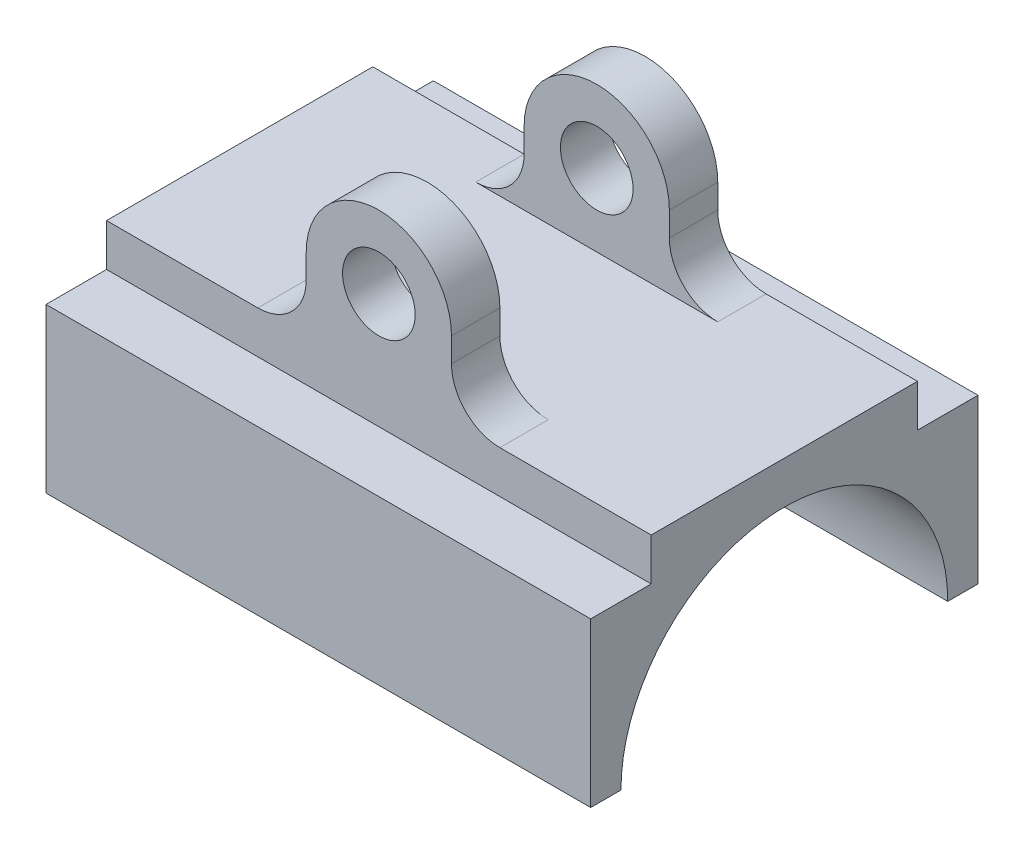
ISO-10303-21;
HEADER;
FILE_DESCRIPTION(('STEP AP214'),'2;1');
FILE_NAME('part.step','',(''),(''),'','','');
FILE_SCHEMA(('AUTOMOTIVE_DESIGN { 1 0 10303 214 1 1 1 1 }'));
ENDSEC;
DATA;
#1=APPLICATION_CONTEXT('core data for automotive mechanical design processes');
#2=APPLICATION_PROTOCOL_DEFINITION('international standard','automotive_design',2000,#1);
#3=PRODUCT_CONTEXT('',#1,'mechanical');
#4=PRODUCT('Part','Part','',(#3));
#5=PRODUCT_RELATED_PRODUCT_CATEGORY('part','',(#4));
#6=PRODUCT_DEFINITION_FORMATION('','',#4);
#7=PRODUCT_DEFINITION_CONTEXT('part definition',#1,'design');
#8=PRODUCT_DEFINITION('design','',#6,#7);
#9=PRODUCT_DEFINITION_SHAPE('','',#8);
#10=(LENGTH_UNIT() NAMED_UNIT(*) SI_UNIT(.MILLI.,.METRE.));
#11=(NAMED_UNIT(*) PLANE_ANGLE_UNIT() SI_UNIT($,.RADIAN.));
#12=(NAMED_UNIT(*) SI_UNIT($,.STERADIAN.) SOLID_ANGLE_UNIT());
#13=UNCERTAINTY_MEASURE_WITH_UNIT(LENGTH_MEASURE(1.E-05),#10,'distance_accuracy_value','');
#14=(GEOMETRIC_REPRESENTATION_CONTEXT(3) GLOBAL_UNCERTAINTY_ASSIGNED_CONTEXT((#13)) GLOBAL_UNIT_ASSIGNED_CONTEXT((#10,
#11,#12)) REPRESENTATION_CONTEXT('',''));
#15=CARTESIAN_POINT('',(0.,0.,0.));
#16=DIRECTION('',(0.,0.,1.));
#17=DIRECTION('',(1.,0.,0.));
#18=AXIS2_PLACEMENT_3D('',#15,#16,#17);
#19=CARTESIAN_POINT('',(-285.75,107.95,-69.85));
#20=DIRECTION('',(0.,0.,-1.));
#21=DIRECTION('',(-1.,0.,0.));
#22=AXIS2_PLACEMENT_3D('',#19,#20,#21);
#23=PLANE('',#22);
#24=DIRECTION('',(0.,1.,0.));
#25=VECTOR('',#24,1.);
#26=CARTESIAN_POINT('',(0.,107.95,-69.85));
#27=LINE('',#26,#25);
#28=CARTESIAN_POINT('',(0.,85.725,-69.85));
#29=VERTEX_POINT('',#28);
#30=CARTESIAN_POINT('',(0.,107.95,-69.85));
#31=VERTEX_POINT('',#30);
#32=EDGE_CURVE('E284',#29,#31,#27,.T.);
#33=ORIENTED_EDGE('',*,*,#32,.F.);
#34=DIRECTION('',(1.,0.,0.));
#35=VECTOR('',#34,1.);
#36=CARTESIAN_POINT('',(-285.75,85.725,-69.85));
#37=LINE('',#36,#35);
#38=CARTESIAN_POINT('',(-285.75,85.725,-69.85));
#39=VERTEX_POINT('',#38);
#40=EDGE_CURVE('E374',#39,#29,#37,.T.);
#41=ORIENTED_EDGE('',*,*,#40,.F.);
#42=DIRECTION('',(0.,1.,0.));
#43=VECTOR('',#42,1.);
#44=CARTESIAN_POINT('',(-285.75,107.95,-69.85));
#45=LINE('',#44,#43);
#46=CARTESIAN_POINT('',(-285.75,107.95,-69.85));
#47=VERTEX_POINT('',#46);
#48=EDGE_CURVE('E254',#39,#47,#45,.T.);
#49=ORIENTED_EDGE('',*,*,#48,.T.);
#50=DIRECTION('',(1.,0.,0.));
#51=VECTOR('',#50,1.);
#52=CARTESIAN_POINT('',(-285.75,107.95,-69.85));
#53=LINE('',#52,#51);
#54=CARTESIAN_POINT('',(-206.375,107.95,-69.85));
#55=VERTEX_POINT('',#54);
#56=EDGE_CURVE('E313',#47,#55,#53,.T.);
#57=ORIENTED_EDGE('',*,*,#56,.T.);
#58=CARTESIAN_POINT('',(-206.375,133.35,-69.85));
#59=DIRECTION('',(0.,0.,-1.));
#60=DIRECTION('',(-1.,0.,0.));
#61=AXIS2_PLACEMENT_3D('',#58,#59,#60);
#62=CIRCLE('',#61,25.4);
#63=CARTESIAN_POINT('',(-180.975,133.35,-69.85));
#64=VERTEX_POINT('',#63);
#65=EDGE_CURVE('E41',#55,#64,#62,.F.);
#66=ORIENTED_EDGE('',*,*,#65,.T.);
#67=DIRECTION('',(0.,-1.,0.));
#68=VECTOR('',#67,1.);
#69=CARTESIAN_POINT('',(-180.975,107.95,-69.85));
#70=LINE('',#69,#68);
#71=CARTESIAN_POINT('',(-180.975,146.05,-69.85));
#72=VERTEX_POINT('',#71);
#73=EDGE_CURVE('E209',#72,#64,#70,.T.);
#74=ORIENTED_EDGE('',*,*,#73,.F.);
#75=CARTESIAN_POINT('',(-142.875,146.05,-69.85));
#76=DIRECTION('',(0.,0.,1.));
#77=DIRECTION('',(-1.,0.,0.));
#78=AXIS2_PLACEMENT_3D('',#75,#76,#77);
#79=CIRCLE('',#78,38.1);
#80=CARTESIAN_POINT('',(-104.775,146.05,-69.85));
#81=VERTEX_POINT('',#80);
#82=EDGE_CURVE('E198',#81,#72,#79,.T.);
#83=ORIENTED_EDGE('',*,*,#82,.F.);
#84=DIRECTION('',(0.,1.,0.));
#85=VECTOR('',#84,1.);
#86=CARTESIAN_POINT('',(-104.775,146.05,-69.85));
#87=LINE('',#86,#85);
#88=CARTESIAN_POINT('',(-104.775,133.35,-69.85));
#89=VERTEX_POINT('',#88);
#90=EDGE_CURVE('E204',#89,#81,#87,.T.);
#91=ORIENTED_EDGE('',*,*,#90,.F.);
#92=CARTESIAN_POINT('',(-79.375,133.35,-69.85));
#93=DIRECTION('',(0.,0.,-1.));
#94=DIRECTION('',(-1.,0.,0.));
#95=AXIS2_PLACEMENT_3D('',#92,#93,#94);
#96=CIRCLE('',#95,25.4);
#97=CARTESIAN_POINT('',(-79.375,107.95,-69.85));
#98=VERTEX_POINT('',#97);
#99=EDGE_CURVE('E355',#89,#98,#96,.F.);
#100=ORIENTED_EDGE('',*,*,#99,.T.);
#101=EDGE_CURVE('E370',#98,#31,#53,.T.);
#102=ORIENTED_EDGE('',*,*,#101,.T.);
#103=EDGE_LOOP('',(#33,#41,#49,#57,#66,#74,#83,#91,#100,#102));
#104=FACE_BOUND('',#103,.T.);
#105=CARTESIAN_POINT('',(-142.875,146.05,-69.85));
#106=DIRECTION('',(0.,0.,1.));
#107=DIRECTION('',(1.,0.,0.));
#108=AXIS2_PLACEMENT_3D('',#105,#106,#107);
#109=CIRCLE('',#108,19.05);
#110=CARTESIAN_POINT('',(-123.825,146.05,-69.85));
#111=VERTEX_POINT('',#110);
#112=EDGE_CURVE('E478',#111,#111,#109,.T.);
#113=ORIENTED_EDGE('',*,*,#112,.T.);
#114=EDGE_LOOP('',(#113));
#115=FACE_BOUND('',#114,.T.);
#116=ADVANCED_FACE('F32',(#104,#115),#23,.T.);
#117=CARTESIAN_POINT('',(-142.875,146.05,-44.45));
#118=DIRECTION('',(0.,0.,1.));
#119=DIRECTION('',(-1.,0.,0.));
#120=AXIS2_PLACEMENT_3D('',#117,#118,#119);
#121=PLANE('',#120);
#122=DIRECTION('',(1.,0.,0.));
#123=VECTOR('',#122,1.);
#124=CARTESIAN_POINT('',(-104.775,107.95,-44.45));
#125=LINE('',#124,#123);
#126=CARTESIAN_POINT('',(-206.375,107.95,-44.45));
#127=VERTEX_POINT('',#126);
#128=CARTESIAN_POINT('',(-79.375,107.95,-44.45));
#129=VERTEX_POINT('',#128);
#130=EDGE_CURVE('E202',#127,#129,#125,.T.);
#131=ORIENTED_EDGE('',*,*,#130,.T.);
#132=CARTESIAN_POINT('',(-79.375,133.35,-44.45));
#133=DIRECTION('',(0.,0.,1.));
#134=DIRECTION('',(1.,0.,0.));
#135=AXIS2_PLACEMENT_3D('',#132,#133,#134);
#136=CIRCLE('',#135,25.4);
#137=CARTESIAN_POINT('',(-104.775,133.35,-44.45));
#138=VERTEX_POINT('',#137);
#139=EDGE_CURVE('E357',#129,#138,#136,.F.);
#140=ORIENTED_EDGE('',*,*,#139,.T.);
#141=DIRECTION('',(0.,1.,0.));
#142=VECTOR('',#141,1.);
#143=CARTESIAN_POINT('',(-104.775,146.05,-44.45));
#144=LINE('',#143,#142);
#145=CARTESIAN_POINT('',(-104.775,146.05,-44.45));
#146=VERTEX_POINT('',#145);
#147=EDGE_CURVE('E189',#138,#146,#144,.T.);
#148=ORIENTED_EDGE('',*,*,#147,.T.);
#149=CARTESIAN_POINT('',(-142.875,146.05,-44.45));
#150=DIRECTION('',(0.,0.,1.));
#151=DIRECTION('',(-1.,0.,0.));
#152=AXIS2_PLACEMENT_3D('',#149,#150,#151);
#153=CIRCLE('',#152,38.1);
#154=CARTESIAN_POINT('',(-180.975,146.05,-44.45));
#155=VERTEX_POINT('',#154);
#156=EDGE_CURVE('E182',#146,#155,#153,.T.);
#157=ORIENTED_EDGE('',*,*,#156,.T.);
#158=DIRECTION('',(0.,-1.,0.));
#159=VECTOR('',#158,1.);
#160=CARTESIAN_POINT('',(-180.975,107.95,-44.45));
#161=LINE('',#160,#159);
#162=CARTESIAN_POINT('',(-180.975,133.35,-44.45));
#163=VERTEX_POINT('',#162);
#164=EDGE_CURVE('E186',#155,#163,#161,.T.);
#165=ORIENTED_EDGE('',*,*,#164,.T.);
#166=CARTESIAN_POINT('',(-206.375,133.35,-44.45));
#167=DIRECTION('',(0.,0.,1.));
#168=DIRECTION('',(1.,0.,0.));
#169=AXIS2_PLACEMENT_3D('',#166,#167,#168);
#170=CIRCLE('',#169,25.4);
#171=EDGE_CURVE('E11',#163,#127,#170,.F.);
#172=ORIENTED_EDGE('',*,*,#171,.T.);
#173=EDGE_LOOP('',(#131,#140,#148,#157,#165,#172));
#174=FACE_BOUND('',#173,.T.);
#175=CARTESIAN_POINT('',(-142.875,146.05,-44.45));
#176=DIRECTION('',(0.,0.,1.));
#177=DIRECTION('',(1.,0.,0.));
#178=AXIS2_PLACEMENT_3D('',#175,#176,#177);
#179=CIRCLE('',#178,19.05);
#180=CARTESIAN_POINT('',(-123.825,146.05,-44.45));
#181=VERTEX_POINT('',#180);
#182=EDGE_CURVE('E36',#181,#181,#179,.F.);
#183=ORIENTED_EDGE('',*,*,#182,.T.);
#184=EDGE_LOOP('',(#183));
#185=FACE_BOUND('',#184,.T.);
#186=ADVANCED_FACE('F184',(#174,#185),#121,.T.);
#187=CARTESIAN_POINT('',(-285.75,107.95,69.85));
#188=DIRECTION('',(0.,1.,0.));
#189=DIRECTION('',(0.,0.,1.));
#190=AXIS2_PLACEMENT_3D('',#187,#188,#189);
#191=PLANE('',#190);
#192=ORIENTED_EDGE('',*,*,#101,.F.);
#193=DIRECTION('',(0.,0.,-1.));
#194=VECTOR('',#193,1.);
#195=CARTESIAN_POINT('',(-79.375,107.95,69.85));
#196=LINE('',#195,#194);
#197=EDGE_CURVE('E351',#98,#129,#196,.F.);
#198=ORIENTED_EDGE('',*,*,#197,.T.);
#199=ORIENTED_EDGE('',*,*,#130,.F.);
#200=DIRECTION('',(0.,0.,-1.));
#201=VECTOR('',#200,1.);
#202=CARTESIAN_POINT('',(-206.375,107.95,69.85));
#203=LINE('',#202,#201);
#204=EDGE_CURVE('E348',#127,#55,#203,.T.);
#205=ORIENTED_EDGE('',*,*,#204,.T.);
#206=ORIENTED_EDGE('',*,*,#56,.F.);
#207=DIRECTION('',(0.,0.,1.));
#208=VECTOR('',#207,1.);
#209=CARTESIAN_POINT('',(-285.75,107.95,69.85));
#210=LINE('',#209,#208);
#211=CARTESIAN_POINT('',(-285.75,107.95,69.85));
#212=VERTEX_POINT('',#211);
#213=EDGE_CURVE('E257',#47,#212,#210,.T.);
#214=ORIENTED_EDGE('',*,*,#213,.T.);
#215=DIRECTION('',(1.,0.,0.));
#216=VECTOR('',#215,1.);
#217=CARTESIAN_POINT('',(-285.75,107.95,69.85));
#218=LINE('',#217,#216);
#219=CARTESIAN_POINT('',(-206.375,107.95,69.85));
#220=VERTEX_POINT('',#219);
#221=EDGE_CURVE('E310',#212,#220,#218,.T.);
#222=ORIENTED_EDGE('',*,*,#221,.T.);
#223=DIRECTION('',(0.,0.,1.));
#224=VECTOR('',#223,1.);
#225=CARTESIAN_POINT('',(-206.375,107.95,44.45));
#226=LINE('',#225,#224);
#227=CARTESIAN_POINT('',(-206.375,107.95,44.45));
#228=VERTEX_POINT('',#227);
#229=EDGE_CURVE('E303',#220,#228,#226,.F.);
#230=ORIENTED_EDGE('',*,*,#229,.T.);
#231=DIRECTION('',(1.,0.,0.));
#232=VECTOR('',#231,1.);
#233=CARTESIAN_POINT('',(-104.775,107.95,44.45));
#234=LINE('',#233,#232);
#235=CARTESIAN_POINT('',(-79.375,107.95,44.45));
#236=VERTEX_POINT('',#235);
#237=EDGE_CURVE('E221',#228,#236,#234,.T.);
#238=ORIENTED_EDGE('',*,*,#237,.T.);
#239=DIRECTION('',(0.,0.,1.));
#240=VECTOR('',#239,1.);
#241=CARTESIAN_POINT('',(-79.375,107.95,69.85));
#242=LINE('',#241,#240);
#243=CARTESIAN_POINT('',(-79.375,107.95,69.85));
#244=VERTEX_POINT('',#243);
#245=EDGE_CURVE('E330',#236,#244,#242,.T.);
#246=ORIENTED_EDGE('',*,*,#245,.T.);
#247=CARTESIAN_POINT('',(0.,107.95,69.85));
#248=VERTEX_POINT('',#247);
#249=EDGE_CURVE('E317',#244,#248,#218,.T.);
#250=ORIENTED_EDGE('',*,*,#249,.T.);
#251=DIRECTION('',(0.,0.,1.));
#252=VECTOR('',#251,1.);
#253=CARTESIAN_POINT('',(0.,107.95,69.85));
#254=LINE('',#253,#252);
#255=EDGE_CURVE('E287',#31,#248,#254,.T.);
#256=ORIENTED_EDGE('',*,*,#255,.F.);
#257=EDGE_LOOP('',(#192,#198,#199,#205,#206,#214,#222,#230,#238,#246,#250,#256));
#258=FACE_BOUND('',#257,.T.);
#259=ADVANCED_FACE('F373',(#258),#191,.T.);
#260=CARTESIAN_POINT('',(-285.75,0.,0.));
#261=DIRECTION('',(1.,0.,0.));
#262=DIRECTION('',(0.,0.,-1.));
#263=AXIS2_PLACEMENT_3D('',#260,#261,#262);
#264=CYLINDRICAL_SURFACE('',#263,85.725);
#265=CARTESIAN_POINT('',(0.,0.,0.));
#266=DIRECTION('',(-1.,0.,0.));
#267=DIRECTION('',(0.,0.,1.));
#268=AXIS2_PLACEMENT_3D('',#265,#266,#267);
#269=CIRCLE('',#268,85.725);
#270=CARTESIAN_POINT('',(0.,0.,85.725));
#271=VERTEX_POINT('',#270);
#272=CARTESIAN_POINT('',(0.,0.,-85.725));
#273=VERTEX_POINT('',#272);
#274=EDGE_CURVE('E238',#271,#273,#269,.T.);
#275=ORIENTED_EDGE('',*,*,#274,.F.);
#276=DIRECTION('',(1.,0.,0.));
#277=VECTOR('',#276,1.);
#278=CARTESIAN_POINT('',(-285.75,0.,85.725));
#279=LINE('',#278,#277);
#280=CARTESIAN_POINT('',(-285.75,0.,85.725));
#281=VERTEX_POINT('',#280);
#282=EDGE_CURVE('E301',#281,#271,#279,.T.);
#283=ORIENTED_EDGE('',*,*,#282,.F.);
#284=CARTESIAN_POINT('',(-285.75,0.,0.));
#285=DIRECTION('',(-1.,0.,0.));
#286=DIRECTION('',(0.,0.,1.));
#287=AXIS2_PLACEMENT_3D('',#284,#285,#286);
#288=CIRCLE('',#287,85.725);
#289=CARTESIAN_POINT('',(-285.75,0.,-85.725));
#290=VERTEX_POINT('',#289);
#291=EDGE_CURVE('E241',#281,#290,#288,.T.);
#292=ORIENTED_EDGE('',*,*,#291,.T.);
#293=DIRECTION('',(1.,0.,0.));
#294=VECTOR('',#293,1.);
#295=CARTESIAN_POINT('',(-285.75,0.,-85.725));
#296=LINE('',#295,#294);
#297=EDGE_CURVE('E272',#290,#273,#296,.T.);
#298=ORIENTED_EDGE('',*,*,#297,.T.);
#299=EDGE_LOOP('',(#275,#283,#292,#298));
#300=FACE_BOUND('',#299,.T.);
#301=ADVANCED_FACE('F385',(#300),#264,.F.);
#302=CARTESIAN_POINT('',(-285.75,0.,85.725));
#303=DIRECTION('',(0.,-1.,0.));
#304=DIRECTION('',(0.,0.,-1.));
#305=AXIS2_PLACEMENT_3D('',#302,#303,#304);
#306=PLANE('',#305);
#307=DIRECTION('',(0.,0.,-1.));
#308=VECTOR('',#307,1.);
#309=CARTESIAN_POINT('',(0.,0.,85.725));
#310=LINE('',#309,#308);
#311=CARTESIAN_POINT('',(0.,0.,101.6));
#312=VERTEX_POINT('',#311);
#313=EDGE_CURVE('E245',#312,#271,#310,.T.);
#314=ORIENTED_EDGE('',*,*,#313,.F.);
#315=DIRECTION('',(1.,0.,0.));
#316=VECTOR('',#315,1.);
#317=CARTESIAN_POINT('',(-285.75,0.,101.6));
#318=LINE('',#317,#316);
#319=CARTESIAN_POINT('',(-285.75,0.,101.6));
#320=VERTEX_POINT('',#319);
#321=EDGE_CURVE('E304',#320,#312,#318,.T.);
#322=ORIENTED_EDGE('',*,*,#321,.F.);
#323=DIRECTION('',(0.,0.,-1.));
#324=VECTOR('',#323,1.);
#325=CARTESIAN_POINT('',(-285.75,0.,85.725));
#326=LINE('',#325,#324);
#327=EDGE_CURVE('E269',#320,#281,#326,.T.);
#328=ORIENTED_EDGE('',*,*,#327,.T.);
#329=ORIENTED_EDGE('',*,*,#282,.T.);
#330=EDGE_LOOP('',(#314,#322,#328,#329));
#331=FACE_BOUND('',#330,.T.);
#332=ADVANCED_FACE('F394',(#331),#306,.T.);
#333=CARTESIAN_POINT('',(-285.75,0.,101.6));
#334=DIRECTION('',(0.,0.,1.));
#335=DIRECTION('',(0.,-1.,0.));
#336=AXIS2_PLACEMENT_3D('',#333,#334,#335);
#337=PLANE('',#336);
#338=DIRECTION('',(0.,-1.,0.));
#339=VECTOR('',#338,1.);
#340=CARTESIAN_POINT('',(0.,0.,101.6));
#341=LINE('',#340,#339);
#342=CARTESIAN_POINT('',(0.,85.725,101.6));
#343=VERTEX_POINT('',#342);
#344=EDGE_CURVE('E296',#343,#312,#341,.T.);
#345=ORIENTED_EDGE('',*,*,#344,.F.);
#346=DIRECTION('',(1.,0.,0.));
#347=VECTOR('',#346,1.);
#348=CARTESIAN_POINT('',(-285.75,85.725,101.6));
#349=LINE('',#348,#347);
#350=CARTESIAN_POINT('',(-285.75,85.725,101.6));
#351=VERTEX_POINT('',#350);
#352=EDGE_CURVE('E306',#351,#343,#349,.T.);
#353=ORIENTED_EDGE('',*,*,#352,.F.);
#354=DIRECTION('',(0.,-1.,0.));
#355=VECTOR('',#354,1.);
#356=CARTESIAN_POINT('',(-285.75,0.,101.6));
#357=LINE('',#356,#355);
#358=EDGE_CURVE('E266',#351,#320,#357,.T.);
#359=ORIENTED_EDGE('',*,*,#358,.T.);
#360=ORIENTED_EDGE('',*,*,#321,.T.);
#361=EDGE_LOOP('',(#345,#353,#359,#360));
#362=FACE_BOUND('',#361,.T.);
#363=ADVANCED_FACE('F427',(#362),#337,.T.);
#364=CARTESIAN_POINT('',(-285.75,85.725,101.6));
#365=DIRECTION('',(0.,1.,0.));
#366=DIRECTION('',(0.,0.,1.));
#367=AXIS2_PLACEMENT_3D('',#364,#365,#366);
#368=PLANE('',#367);
#369=DIRECTION('',(0.,0.,1.));
#370=VECTOR('',#369,1.);
#371=CARTESIAN_POINT('',(0.,85.725,101.6));
#372=LINE('',#371,#370);
#373=CARTESIAN_POINT('',(0.,85.725,69.85));
#374=VERTEX_POINT('',#373);
#375=EDGE_CURVE('E293',#374,#343,#372,.T.);
#376=ORIENTED_EDGE('',*,*,#375,.F.);
#377=DIRECTION('',(1.,0.,0.));
#378=VECTOR('',#377,1.);
#379=CARTESIAN_POINT('',(-285.75,85.725,69.85));
#380=LINE('',#379,#378);
#381=CARTESIAN_POINT('',(-285.75,85.725,69.85));
#382=VERTEX_POINT('',#381);
#383=EDGE_CURVE('E308',#382,#374,#380,.T.);
#384=ORIENTED_EDGE('',*,*,#383,.F.);
#385=DIRECTION('',(0.,0.,1.));
#386=VECTOR('',#385,1.);
#387=CARTESIAN_POINT('',(-285.75,85.725,101.6));
#388=LINE('',#387,#386);
#389=EDGE_CURVE('E263',#382,#351,#388,.T.);
#390=ORIENTED_EDGE('',*,*,#389,.T.);
#391=ORIENTED_EDGE('',*,*,#352,.T.);
#392=EDGE_LOOP('',(#376,#384,#390,#391));
#393=FACE_BOUND('',#392,.T.);
#394=ADVANCED_FACE('F413',(#393),#368,.T.);
#395=CARTESIAN_POINT('',(-285.75,85.725,69.85));
#396=DIRECTION('',(0.,0.,1.));
#397=DIRECTION('',(1.,0.,0.));
#398=AXIS2_PLACEMENT_3D('',#395,#396,#397);
#399=PLANE('',#398);
#400=CARTESIAN_POINT('',(-142.875,146.05,69.85));
#401=DIRECTION('',(0.,0.,1.));
#402=DIRECTION('',(1.,0.,0.));
#403=AXIS2_PLACEMENT_3D('',#400,#401,#402);
#404=CIRCLE('',#403,19.05);
#405=CARTESIAN_POINT('',(-123.825,146.05,69.85));
#406=VERTEX_POINT('',#405);
#407=EDGE_CURVE('E213',#406,#406,#404,.T.);
#408=ORIENTED_EDGE('',*,*,#407,.F.);
#409=EDGE_LOOP('',(#408));
#410=FACE_BOUND('',#409,.T.);
#411=DIRECTION('',(0.,-1.,0.));
#412=VECTOR('',#411,1.);
#413=CARTESIAN_POINT('',(0.,85.725,69.85));
#414=LINE('',#413,#412);
#415=EDGE_CURVE('E290',#248,#374,#414,.T.);
#416=ORIENTED_EDGE('',*,*,#415,.F.);
#417=ORIENTED_EDGE('',*,*,#249,.F.);
#418=CARTESIAN_POINT('',(-79.375,133.35,69.85));
#419=DIRECTION('',(0.,0.,1.));
#420=DIRECTION('',(1.,0.,0.));
#421=AXIS2_PLACEMENT_3D('',#418,#419,#420);
#422=CIRCLE('',#421,25.4);
#423=CARTESIAN_POINT('',(-104.775,133.35,69.85));
#424=VERTEX_POINT('',#423);
#425=EDGE_CURVE('E336',#244,#424,#422,.F.);
#426=ORIENTED_EDGE('',*,*,#425,.T.);
#427=DIRECTION('',(0.,1.,0.));
#428=VECTOR('',#427,1.);
#429=CARTESIAN_POINT('',(-104.775,146.05,69.85));
#430=LINE('',#429,#428);
#431=CARTESIAN_POINT('',(-104.775,146.05,69.85));
#432=VERTEX_POINT('',#431);
#433=EDGE_CURVE('E220',#424,#432,#430,.T.);
#434=ORIENTED_EDGE('',*,*,#433,.T.);
#435=CARTESIAN_POINT('',(-142.875,146.05,69.85));
#436=DIRECTION('',(0.,0.,1.));
#437=DIRECTION('',(-1.,0.,0.));
#438=AXIS2_PLACEMENT_3D('',#435,#436,#437);
#439=CIRCLE('',#438,38.1);
#440=CARTESIAN_POINT('',(-180.975,146.05,69.85));
#441=VERTEX_POINT('',#440);
#442=EDGE_CURVE('E233',#432,#441,#439,.T.);
#443=ORIENTED_EDGE('',*,*,#442,.T.);
#444=DIRECTION('',(0.,-1.,0.));
#445=VECTOR('',#444,1.);
#446=CARTESIAN_POINT('',(-180.975,107.95,69.85));
#447=LINE('',#446,#445);
#448=CARTESIAN_POINT('',(-180.975,133.35,69.85));
#449=VERTEX_POINT('',#448);
#450=EDGE_CURVE('E224',#441,#449,#447,.T.);
#451=ORIENTED_EDGE('',*,*,#450,.T.);
#452=CARTESIAN_POINT('',(-206.375,133.35,69.85));
#453=DIRECTION('',(0.,0.,1.));
#454=DIRECTION('',(1.,0.,0.));
#455=AXIS2_PLACEMENT_3D('',#452,#453,#454);
#456=CIRCLE('',#455,25.4);
#457=EDGE_CURVE('E341',#449,#220,#456,.F.);
#458=ORIENTED_EDGE('',*,*,#457,.T.);
#459=ORIENTED_EDGE('',*,*,#221,.F.);
#460=DIRECTION('',(0.,-1.,0.));
#461=VECTOR('',#460,1.);
#462=CARTESIAN_POINT('',(-285.75,85.725,69.85));
#463=LINE('',#462,#461);
#464=EDGE_CURVE('E260',#212,#382,#463,.T.);
#465=ORIENTED_EDGE('',*,*,#464,.T.);
#466=ORIENTED_EDGE('',*,*,#383,.T.);
#467=EDGE_LOOP('',(#416,#417,#426,#434,#443,#451,#458,#459,#465,#466));
#468=FACE_BOUND('',#467,.T.);
#469=ADVANCED_FACE('F406',(#410,#468),#399,.T.);
#470=CARTESIAN_POINT('',(-285.75,85.725,-69.85));
#471=DIRECTION('',(0.,1.,0.));
#472=DIRECTION('',(0.,0.,1.));
#473=AXIS2_PLACEMENT_3D('',#470,#471,#472);
#474=PLANE('',#473);
#475=DIRECTION('',(0.,0.,1.));
#476=VECTOR('',#475,1.);
#477=CARTESIAN_POINT('',(0.,85.725,-69.85));
#478=LINE('',#477,#476);
#479=CARTESIAN_POINT('',(0.,85.725,-101.6));
#480=VERTEX_POINT('',#479);
#481=EDGE_CURVE('E281',#480,#29,#478,.T.);
#482=ORIENTED_EDGE('',*,*,#481,.F.);
#483=DIRECTION('',(1.,0.,0.));
#484=VECTOR('',#483,1.);
#485=CARTESIAN_POINT('',(-285.75,85.725,-101.6));
#486=LINE('',#485,#484);
#487=CARTESIAN_POINT('',(-285.75,85.725,-101.6));
#488=VERTEX_POINT('',#487);
#489=EDGE_CURVE('E375',#488,#480,#486,.T.);
#490=ORIENTED_EDGE('',*,*,#489,.F.);
#491=DIRECTION('',(0.,0.,1.));
#492=VECTOR('',#491,1.);
#493=CARTESIAN_POINT('',(-285.75,85.725,-69.85));
#494=LINE('',#493,#492);
#495=EDGE_CURVE('E251',#488,#39,#494,.T.);
#496=ORIENTED_EDGE('',*,*,#495,.T.);
#497=ORIENTED_EDGE('',*,*,#40,.T.);
#498=EDGE_LOOP('',(#482,#490,#496,#497));
#499=FACE_BOUND('',#498,.T.);
#500=ADVANCED_FACE('F404',(#499),#474,.T.);
#501=CARTESIAN_POINT('',(-285.75,85.725,-101.6));
#502=DIRECTION('',(0.,0.,-1.));
#503=DIRECTION('',(0.,1.,0.));
#504=AXIS2_PLACEMENT_3D('',#501,#502,#503);
#505=PLANE('',#504);
#506=DIRECTION('',(0.,1.,0.));
#507=VECTOR('',#506,1.);
#508=CARTESIAN_POINT('',(0.,85.725,-101.6));
#509=LINE('',#508,#507);
#510=CARTESIAN_POINT('',(0.,0.,-101.6));
#511=VERTEX_POINT('',#510);
#512=EDGE_CURVE('E278',#511,#480,#509,.T.);
#513=ORIENTED_EDGE('',*,*,#512,.F.);
#514=DIRECTION('',(1.,0.,0.));
#515=VECTOR('',#514,1.);
#516=CARTESIAN_POINT('',(-285.75,0.,-101.6));
#517=LINE('',#516,#515);
#518=CARTESIAN_POINT('',(-285.75,0.,-101.6));
#519=VERTEX_POINT('',#518);
#520=EDGE_CURVE('E378',#519,#511,#517,.T.);
#521=ORIENTED_EDGE('',*,*,#520,.F.);
#522=DIRECTION('',(0.,1.,0.));
#523=VECTOR('',#522,1.);
#524=CARTESIAN_POINT('',(-285.75,85.725,-101.6));
#525=LINE('',#524,#523);
#526=EDGE_CURVE('E248',#519,#488,#525,.T.);
#527=ORIENTED_EDGE('',*,*,#526,.T.);
#528=ORIENTED_EDGE('',*,*,#489,.T.);
#529=EDGE_LOOP('',(#513,#521,#527,#528));
#530=FACE_BOUND('',#529,.T.);
#531=ADVANCED_FACE('F403',(#530),#505,.T.);
#532=CARTESIAN_POINT('',(-285.75,0.,-101.6));
#533=DIRECTION('',(0.,-1.,0.));
#534=DIRECTION('',(0.,0.,-1.));
#535=AXIS2_PLACEMENT_3D('',#532,#533,#534);
#536=PLANE('',#535);
#537=DIRECTION('',(0.,0.,-1.));
#538=VECTOR('',#537,1.);
#539=CARTESIAN_POINT('',(0.,0.,-101.6));
#540=LINE('',#539,#538);
#541=EDGE_CURVE('E275',#273,#511,#540,.T.);
#542=ORIENTED_EDGE('',*,*,#541,.F.);
#543=ORIENTED_EDGE('',*,*,#297,.F.);
#544=DIRECTION('',(0.,0.,-1.));
#545=VECTOR('',#544,1.);
#546=CARTESIAN_POINT('',(-285.75,0.,-101.6));
#547=LINE('',#546,#545);
#548=EDGE_CURVE('E244',#290,#519,#547,.T.);
#549=ORIENTED_EDGE('',*,*,#548,.T.);
#550=ORIENTED_EDGE('',*,*,#520,.T.);
#551=EDGE_LOOP('',(#542,#543,#549,#550));
#552=FACE_BOUND('',#551,.T.);
#553=ADVANCED_FACE('F388',(#552),#536,.T.);
#554=CARTESIAN_POINT('',(-285.75,0.,0.));
#555=DIRECTION('',(-1.,0.,0.));
#556=DIRECTION('',(0.,0.,1.));
#557=AXIS2_PLACEMENT_3D('',#554,#555,#556);
#558=PLANE('',#557);
#559=ORIENTED_EDGE('',*,*,#291,.F.);
#560=ORIENTED_EDGE('',*,*,#327,.F.);
#561=ORIENTED_EDGE('',*,*,#358,.F.);
#562=ORIENTED_EDGE('',*,*,#389,.F.);
#563=ORIENTED_EDGE('',*,*,#464,.F.);
#564=ORIENTED_EDGE('',*,*,#213,.F.);
#565=ORIENTED_EDGE('',*,*,#48,.F.);
#566=ORIENTED_EDGE('',*,*,#495,.F.);
#567=ORIENTED_EDGE('',*,*,#526,.F.);
#568=ORIENTED_EDGE('',*,*,#548,.F.);
#569=EDGE_LOOP('',(#559,#560,#561,#562,#563,#564,#565,#566,#567,#568));
#570=FACE_BOUND('',#569,.T.);
#571=ADVANCED_FACE('F397',(#570),#558,.T.);
#572=CARTESIAN_POINT('',(0.,0.,0.));
#573=DIRECTION('',(-1.,0.,0.));
#574=DIRECTION('',(0.,0.,1.));
#575=AXIS2_PLACEMENT_3D('',#572,#573,#574);
#576=PLANE('',#575);
#577=ORIENTED_EDGE('',*,*,#274,.T.);
#578=ORIENTED_EDGE('',*,*,#541,.T.);
#579=ORIENTED_EDGE('',*,*,#512,.T.);
#580=ORIENTED_EDGE('',*,*,#481,.T.);
#581=ORIENTED_EDGE('',*,*,#32,.T.);
#582=ORIENTED_EDGE('',*,*,#255,.T.);
#583=ORIENTED_EDGE('',*,*,#415,.T.);
#584=ORIENTED_EDGE('',*,*,#375,.T.);
#585=ORIENTED_EDGE('',*,*,#344,.T.);
#586=ORIENTED_EDGE('',*,*,#313,.T.);
#587=EDGE_LOOP('',(#577,#578,#579,#580,#581,#582,#583,#584,#585,#586));
#588=FACE_BOUND('',#587,.T.);
#589=ADVANCED_FACE('F390',(#588),#576,.F.);
#590=CARTESIAN_POINT('',(-180.975,107.95,44.45));
#591=DIRECTION('',(-1.,0.,0.));
#592=DIRECTION('',(0.,0.,1.));
#593=AXIS2_PLACEMENT_3D('',#590,#591,#592);
#594=PLANE('',#593);
#595=DIRECTION('',(0.,-1.,0.));
#596=VECTOR('',#595,1.);
#597=CARTESIAN_POINT('',(-180.975,107.95,44.45));
#598=LINE('',#597,#596);
#599=CARTESIAN_POINT('',(-180.975,146.05,44.45));
#600=VERTEX_POINT('',#599);
#601=CARTESIAN_POINT('',(-180.975,133.35,44.45));
#602=VERTEX_POINT('',#601);
#603=EDGE_CURVE('E229',#600,#602,#598,.T.);
#604=ORIENTED_EDGE('',*,*,#603,.T.);
#605=DIRECTION('',(0.,0.,1.));
#606=VECTOR('',#605,1.);
#607=CARTESIAN_POINT('',(-180.975,133.35,69.85));
#608=LINE('',#607,#606);
#609=EDGE_CURVE('E333',#602,#449,#608,.T.);
#610=ORIENTED_EDGE('',*,*,#609,.T.);
#611=ORIENTED_EDGE('',*,*,#450,.F.);
#612=DIRECTION('',(0.,0.,1.));
#613=VECTOR('',#612,1.);
#614=CARTESIAN_POINT('',(-180.975,146.05,44.45));
#615=LINE('',#614,#613);
#616=EDGE_CURVE('E236',#600,#441,#615,.T.);
#617=ORIENTED_EDGE('',*,*,#616,.F.);
#618=EDGE_LOOP('',(#604,#610,#611,#617));
#619=FACE_BOUND('',#618,.T.);
#620=ADVANCED_FACE('F436',(#619),#594,.T.);
#621=CARTESIAN_POINT('',(-142.875,146.05,44.45));
#622=DIRECTION('',(0.,0.,1.));
#623=DIRECTION('',(1.,0.,0.));
#624=AXIS2_PLACEMENT_3D('',#621,#622,#623);
#625=CYLINDRICAL_SURFACE('',#624,38.1);
#626=ORIENTED_EDGE('',*,*,#442,.F.);
#627=DIRECTION('',(0.,0.,1.));
#628=VECTOR('',#627,1.);
#629=CARTESIAN_POINT('',(-104.775,146.05,44.45));
#630=LINE('',#629,#628);
#631=CARTESIAN_POINT('',(-104.775,146.05,44.45));
#632=VERTEX_POINT('',#631);
#633=EDGE_CURVE('E232',#632,#432,#630,.T.);
#634=ORIENTED_EDGE('',*,*,#633,.F.);
#635=CARTESIAN_POINT('',(-142.875,146.05,44.45));
#636=DIRECTION('',(0.,0.,1.));
#637=DIRECTION('',(-1.,0.,0.));
#638=AXIS2_PLACEMENT_3D('',#635,#636,#637);
#639=CIRCLE('',#638,38.1);
#640=EDGE_CURVE('E226',#632,#600,#639,.T.);
#641=ORIENTED_EDGE('',*,*,#640,.T.);
#642=ORIENTED_EDGE('',*,*,#616,.T.);
#643=EDGE_LOOP('',(#626,#634,#641,#642));
#644=FACE_BOUND('',#643,.T.);
#645=ADVANCED_FACE('F443',(#644),#625,.T.);
#646=CARTESIAN_POINT('',(-104.775,146.05,44.45));
#647=DIRECTION('',(1.,0.,0.));
#648=DIRECTION('',(0.,1.,0.));
#649=AXIS2_PLACEMENT_3D('',#646,#647,#648);
#650=PLANE('',#649);
#651=ORIENTED_EDGE('',*,*,#433,.F.);
#652=DIRECTION('',(0.,0.,1.));
#653=VECTOR('',#652,1.);
#654=CARTESIAN_POINT('',(-104.775,133.35,44.45));
#655=LINE('',#654,#653);
#656=CARTESIAN_POINT('',(-104.775,133.35,44.45));
#657=VERTEX_POINT('',#656);
#658=EDGE_CURVE('E331',#424,#657,#655,.F.);
#659=ORIENTED_EDGE('',*,*,#658,.T.);
#660=DIRECTION('',(0.,1.,0.));
#661=VECTOR('',#660,1.);
#662=CARTESIAN_POINT('',(-104.775,146.05,44.45));
#663=LINE('',#662,#661);
#664=EDGE_CURVE('E223',#657,#632,#663,.T.);
#665=ORIENTED_EDGE('',*,*,#664,.T.);
#666=ORIENTED_EDGE('',*,*,#633,.T.);
#667=EDGE_LOOP('',(#651,#659,#665,#666));
#668=FACE_BOUND('',#667,.T.);
#669=ADVANCED_FACE('F439',(#668),#650,.T.);
#670=CARTESIAN_POINT('',(-142.875,146.05,44.45));
#671=DIRECTION('',(0.,0.,-1.));
#672=DIRECTION('',(-1.,0.,0.));
#673=AXIS2_PLACEMENT_3D('',#670,#671,#672);
#674=PLANE('',#673);
#675=CARTESIAN_POINT('',(-142.875,146.05,44.45));
#676=DIRECTION('',(0.,0.,-1.));
#677=DIRECTION('',(-1.,0.,0.));
#678=AXIS2_PLACEMENT_3D('',#675,#676,#677);
#679=CIRCLE('',#678,19.05);
#680=CARTESIAN_POINT('',(-161.925,146.05,44.45));
#681=VERTEX_POINT('',#680);
#682=EDGE_CURVE('E217',#681,#681,#679,.F.);
#683=ORIENTED_EDGE('',*,*,#682,.T.);
#684=EDGE_LOOP('',(#683));
#685=FACE_BOUND('',#684,.T.);
#686=ORIENTED_EDGE('',*,*,#237,.F.);
#687=CARTESIAN_POINT('',(-206.375,133.35,44.45));
#688=DIRECTION('',(0.,0.,-1.));
#689=DIRECTION('',(-1.,0.,0.));
#690=AXIS2_PLACEMENT_3D('',#687,#688,#689);
#691=CIRCLE('',#690,25.4);
#692=EDGE_CURVE('E343',#228,#602,#691,.F.);
#693=ORIENTED_EDGE('',*,*,#692,.T.);
#694=ORIENTED_EDGE('',*,*,#603,.F.);
#695=ORIENTED_EDGE('',*,*,#640,.F.);
#696=ORIENTED_EDGE('',*,*,#664,.F.);
#697=CARTESIAN_POINT('',(-79.375,133.35,44.45));
#698=DIRECTION('',(0.,0.,-1.));
#699=DIRECTION('',(-1.,0.,0.));
#700=AXIS2_PLACEMENT_3D('',#697,#698,#699);
#701=CIRCLE('',#700,25.4);
#702=EDGE_CURVE('E338',#657,#236,#701,.F.);
#703=ORIENTED_EDGE('',*,*,#702,.T.);
#704=EDGE_LOOP('',(#686,#693,#694,#695,#696,#703));
#705=FACE_BOUND('',#704,.T.);
#706=ADVANCED_FACE('F442',(#685,#705),#674,.T.);
#707=CARTESIAN_POINT('',(-79.375,133.35,69.85));
#708=DIRECTION('',(0.,0.,-1.));
#709=DIRECTION('',(-1.,0.,0.));
#710=AXIS2_PLACEMENT_3D('',#707,#708,#709);
#711=CYLINDRICAL_SURFACE('',#710,25.4);
#712=ORIENTED_EDGE('',*,*,#702,.F.);
#713=ORIENTED_EDGE('',*,*,#658,.F.);
#714=ORIENTED_EDGE('',*,*,#425,.F.);
#715=ORIENTED_EDGE('',*,*,#245,.F.);
#716=EDGE_LOOP('',(#712,#713,#714,#715));
#717=FACE_BOUND('',#716,.T.);
#718=ADVANCED_FACE('F453',(#717),#711,.F.);
#719=CARTESIAN_POINT('',(-206.375,133.35,44.45));
#720=DIRECTION('',(0.,0.,-1.));
#721=DIRECTION('',(-1.,0.,0.));
#722=AXIS2_PLACEMENT_3D('',#719,#720,#721);
#723=CYLINDRICAL_SURFACE('',#722,25.4);
#724=ORIENTED_EDGE('',*,*,#692,.F.);
#725=ORIENTED_EDGE('',*,*,#229,.F.);
#726=ORIENTED_EDGE('',*,*,#457,.F.);
#727=ORIENTED_EDGE('',*,*,#609,.F.);
#728=EDGE_LOOP('',(#724,#725,#726,#727));
#729=FACE_BOUND('',#728,.T.);
#730=ADVANCED_FACE('F458',(#729),#723,.F.);
#731=CARTESIAN_POINT('',(-142.875,146.05,-9.43153672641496));
#732=DIRECTION('',(0.,0.,1.));
#733=DIRECTION('',(1.,0.,0.));
#734=AXIS2_PLACEMENT_3D('',#731,#732,#733);
#735=CYLINDRICAL_SURFACE('',#734,19.05);
#736=ORIENTED_EDGE('',*,*,#407,.T.);
#737=EDGE_LOOP('',(#736));
#738=FACE_BOUND('',#737,.T.);
#739=ORIENTED_EDGE('',*,*,#682,.F.);
#740=EDGE_LOOP('',(#739));
#741=FACE_BOUND('',#740,.T.);
#742=ADVANCED_FACE('F455',(#738,#741),#735,.F.);
#743=CARTESIAN_POINT('',(-104.775,146.05,-44.45));
#744=DIRECTION('',(-1.,0.,0.));
#745=DIRECTION('',(0.,-1.,0.));
#746=AXIS2_PLACEMENT_3D('',#743,#744,#745);
#747=PLANE('',#746);
#748=ORIENTED_EDGE('',*,*,#147,.F.);
#749=DIRECTION('',(0.,0.,-1.));
#750=VECTOR('',#749,1.);
#751=CARTESIAN_POINT('',(-104.775,133.35,-44.45));
#752=LINE('',#751,#750);
#753=EDGE_CURVE('E345',#138,#89,#752,.T.);
#754=ORIENTED_EDGE('',*,*,#753,.T.);
#755=ORIENTED_EDGE('',*,*,#90,.T.);
#756=DIRECTION('',(0.,0.,-1.));
#757=VECTOR('',#756,1.);
#758=CARTESIAN_POINT('',(-104.775,146.05,-44.45));
#759=LINE('',#758,#757);
#760=EDGE_CURVE('E199',#146,#81,#759,.T.);
#761=ORIENTED_EDGE('',*,*,#760,.F.);
#762=EDGE_LOOP('',(#748,#754,#755,#761));
#763=FACE_BOUND('',#762,.T.);
#764=ADVANCED_FACE('F364',(#763),#747,.F.);
#765=CARTESIAN_POINT('',(-142.875,146.05,-44.45));
#766=DIRECTION('',(0.,0.,-1.));
#767=DIRECTION('',(-1.,0.,0.));
#768=AXIS2_PLACEMENT_3D('',#765,#766,#767);
#769=CYLINDRICAL_SURFACE('',#768,38.1);
#770=ORIENTED_EDGE('',*,*,#82,.T.);
#771=DIRECTION('',(0.,0.,-1.));
#772=VECTOR('',#771,1.);
#773=CARTESIAN_POINT('',(-180.975,146.05,-44.45));
#774=LINE('',#773,#772);
#775=EDGE_CURVE('E195',#155,#72,#774,.T.);
#776=ORIENTED_EDGE('',*,*,#775,.F.);
#777=ORIENTED_EDGE('',*,*,#156,.F.);
#778=ORIENTED_EDGE('',*,*,#760,.T.);
#779=EDGE_LOOP('',(#770,#776,#777,#778));
#780=FACE_BOUND('',#779,.T.);
#781=ADVANCED_FACE('F196',(#780),#769,.T.);
#782=CARTESIAN_POINT('',(-180.975,107.95,-44.45));
#783=DIRECTION('',(1.,0.,0.));
#784=DIRECTION('',(0.,0.,-1.));
#785=AXIS2_PLACEMENT_3D('',#782,#783,#784);
#786=PLANE('',#785);
#787=ORIENTED_EDGE('',*,*,#73,.T.);
#788=DIRECTION('',(0.,0.,-1.));
#789=VECTOR('',#788,1.);
#790=CARTESIAN_POINT('',(-180.975,133.35,-44.45));
#791=LINE('',#790,#789);
#792=EDGE_CURVE('E48',#64,#163,#791,.F.);
#793=ORIENTED_EDGE('',*,*,#792,.T.);
#794=ORIENTED_EDGE('',*,*,#164,.F.);
#795=ORIENTED_EDGE('',*,*,#775,.T.);
#796=EDGE_LOOP('',(#787,#793,#794,#795));
#797=FACE_BOUND('',#796,.T.);
#798=ADVANCED_FACE('F201',(#797),#786,.F.);
#799=CARTESIAN_POINT('',(-79.375,133.35,-44.45));
#800=DIRECTION('',(0.,0.,-1.));
#801=DIRECTION('',(-1.,0.,0.));
#802=AXIS2_PLACEMENT_3D('',#799,#800,#801);
#803=CYLINDRICAL_SURFACE('',#802,25.4);
#804=ORIENTED_EDGE('',*,*,#139,.F.);
#805=ORIENTED_EDGE('',*,*,#197,.F.);
#806=ORIENTED_EDGE('',*,*,#99,.F.);
#807=ORIENTED_EDGE('',*,*,#753,.F.);
#808=EDGE_LOOP('',(#804,#805,#806,#807));
#809=FACE_BOUND('',#808,.T.);
#810=ADVANCED_FACE('F366',(#809),#803,.F.);
#811=CARTESIAN_POINT('',(-206.375,133.35,69.85));
#812=DIRECTION('',(0.,0.,-1.));
#813=DIRECTION('',(-1.,0.,0.));
#814=AXIS2_PLACEMENT_3D('',#811,#812,#813);
#815=CYLINDRICAL_SURFACE('',#814,25.4);
#816=ORIENTED_EDGE('',*,*,#171,.F.);
#817=ORIENTED_EDGE('',*,*,#792,.F.);
#818=ORIENTED_EDGE('',*,*,#65,.F.);
#819=ORIENTED_EDGE('',*,*,#204,.F.);
#820=EDGE_LOOP('',(#816,#817,#818,#819));
#821=FACE_BOUND('',#820,.T.);
#822=ADVANCED_FACE('F34',(#821),#815,.F.);
#823=CARTESIAN_POINT('',(-142.875,146.05,98.3315367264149));
#824=DIRECTION('',(0.,0.,-1.));
#825=DIRECTION('',(-1.,0.,0.));
#826=AXIS2_PLACEMENT_3D('',#823,#824,#825);
#827=CYLINDRICAL_SURFACE('',#826,19.05);
#828=ORIENTED_EDGE('',*,*,#182,.F.);
#829=EDGE_LOOP('',(#828));
#830=FACE_BOUND('',#829,.T.);
#831=ORIENTED_EDGE('',*,*,#112,.F.);
#832=EDGE_LOOP('',(#831));
#833=FACE_BOUND('',#832,.T.);
#834=ADVANCED_FACE('F466',(#830,#833),#827,.F.);
#835=CLOSED_SHELL('',(#116,#186,#259,#301,#332,#363,#394,#469,#500,#531,#553,#571,#589,#620,
#645,#669,#706,#718,#730,#742,#764,#781,#798,#810,#822,#834));
#836=MANIFOLD_SOLID_BREP('B2',#835);
#837=ADVANCED_BREP_SHAPE_REPRESENTATION('',(#18,#836),#14);
#838=SHAPE_DEFINITION_REPRESENTATION(#9,#837);
ENDSEC;
END-ISO-10303-21;
